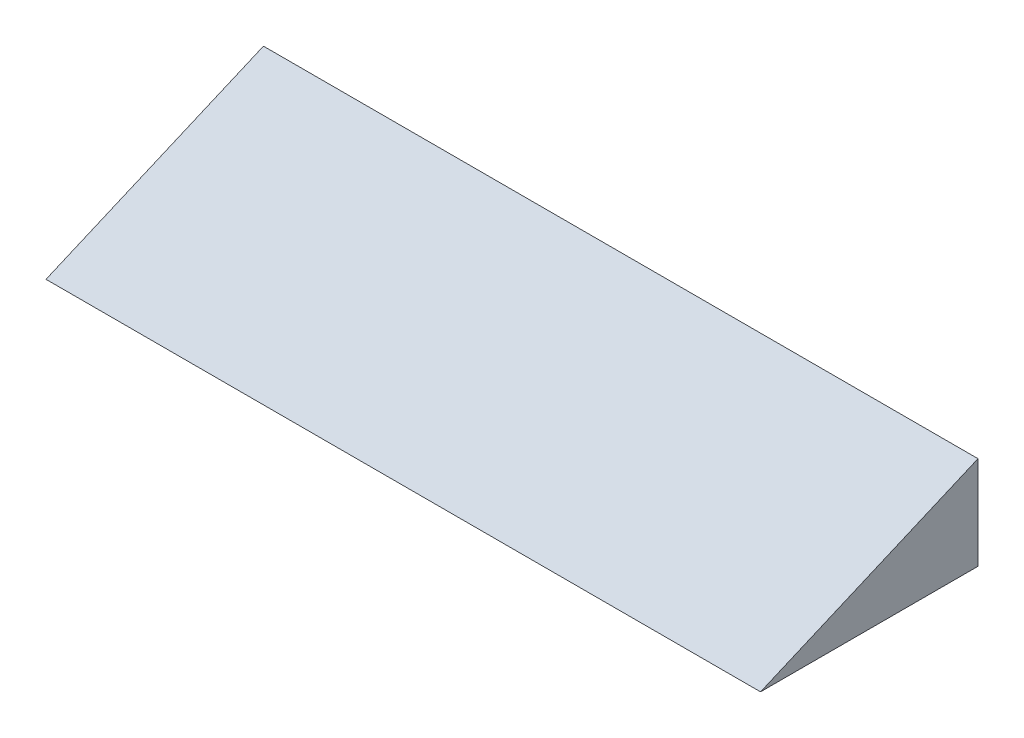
ISO-10303-21;
HEADER;
FILE_DESCRIPTION(('STEP AP214'),'2;1');
FILE_NAME('part.step','',(''),(''),'','','');
FILE_SCHEMA(('AUTOMOTIVE_DESIGN { 1 0 10303 214 1 1 1 1 }'));
ENDSEC;
DATA;
#1=APPLICATION_CONTEXT('core data for automotive mechanical design processes');
#2=APPLICATION_PROTOCOL_DEFINITION('international standard','automotive_design',2000,#1);
#3=PRODUCT_CONTEXT('',#1,'mechanical');
#4=PRODUCT('Part','Part','',(#3));
#5=PRODUCT_RELATED_PRODUCT_CATEGORY('part','',(#4));
#6=PRODUCT_DEFINITION_FORMATION('','',#4);
#7=PRODUCT_DEFINITION_CONTEXT('part definition',#1,'design');
#8=PRODUCT_DEFINITION('design','',#6,#7);
#9=PRODUCT_DEFINITION_SHAPE('','',#8);
#10=(LENGTH_UNIT() NAMED_UNIT(*) SI_UNIT(.MILLI.,.METRE.));
#11=(NAMED_UNIT(*) PLANE_ANGLE_UNIT() SI_UNIT($,.RADIAN.));
#12=(NAMED_UNIT(*) SI_UNIT($,.STERADIAN.) SOLID_ANGLE_UNIT());
#13=UNCERTAINTY_MEASURE_WITH_UNIT(LENGTH_MEASURE(1.E-05),#10,'distance_accuracy_value','');
#14=(GEOMETRIC_REPRESENTATION_CONTEXT(3) GLOBAL_UNCERTAINTY_ASSIGNED_CONTEXT((#13)) GLOBAL_UNIT_ASSIGNED_CONTEXT((#10,
#11,#12)) REPRESENTATION_CONTEXT('',''));
#15=CARTESIAN_POINT('',(0.,0.,0.));
#16=DIRECTION('',(0.,0.,1.));
#17=DIRECTION('',(1.,0.,0.));
#18=AXIS2_PLACEMENT_3D('',#15,#16,#17);
#19=CARTESIAN_POINT('',(292.1,0.,88.9));
#20=DIRECTION('',(0.,1.,0.));
#21=DIRECTION('',(0.,0.,1.));
#22=AXIS2_PLACEMENT_3D('',#19,#20,#21);
#23=PLANE('',#22);
#24=DIRECTION('',(0.,0.,-1.));
#25=VECTOR('',#24,1.);
#26=CARTESIAN_POINT('',(0.,0.,88.9));
#27=LINE('',#26,#25);
#28=CARTESIAN_POINT('',(0.,0.,88.9));
#29=VERTEX_POINT('',#28);
#30=CARTESIAN_POINT('',(0.,0.,0.));
#31=VERTEX_POINT('',#30);
#32=EDGE_CURVE('E77',#29,#31,#27,.T.);
#33=ORIENTED_EDGE('',*,*,#32,.T.);
#34=DIRECTION('',(-1.,0.,0.));
#35=VECTOR('',#34,1.);
#36=CARTESIAN_POINT('',(292.1,0.,0.));
#37=LINE('',#36,#35);
#38=CARTESIAN_POINT('',(292.1,0.,0.));
#39=VERTEX_POINT('',#38);
#40=EDGE_CURVE('E11',#39,#31,#37,.T.);
#41=ORIENTED_EDGE('',*,*,#40,.F.);
#42=DIRECTION('',(0.,0.,-1.));
#43=VECTOR('',#42,1.);
#44=CARTESIAN_POINT('',(292.1,0.,88.9));
#45=LINE('',#44,#43);
#46=CARTESIAN_POINT('',(292.1,0.,88.9));
#47=VERTEX_POINT('',#46);
#48=EDGE_CURVE('E70',#47,#39,#45,.T.);
#49=ORIENTED_EDGE('',*,*,#48,.F.);
#50=DIRECTION('',(-1.,0.,0.));
#51=VECTOR('',#50,1.);
#52=CARTESIAN_POINT('',(292.1,0.,88.9));
#53=LINE('',#52,#51);
#54=EDGE_CURVE('E78',#47,#29,#53,.T.);
#55=ORIENTED_EDGE('',*,*,#54,.T.);
#56=EDGE_LOOP('',(#33,#41,#49,#55));
#57=FACE_BOUND('',#56,.T.);
#58=ADVANCED_FACE('F30',(#57),#23,.F.);
#59=CARTESIAN_POINT('',(292.1,0.,0.));
#60=DIRECTION('',(0.,0.,1.));
#61=DIRECTION('',(1.,0.,0.));
#62=AXIS2_PLACEMENT_3D('',#59,#60,#61);
#63=PLANE('',#62);
#64=DIRECTION('',(0.,1.,0.));
#65=VECTOR('',#64,1.);
#66=CARTESIAN_POINT('',(0.,0.,0.));
#67=LINE('',#66,#65);
#68=CARTESIAN_POINT('',(0.,38.1,0.));
#69=VERTEX_POINT('',#68);
#70=EDGE_CURVE('E58',#31,#69,#67,.T.);
#71=ORIENTED_EDGE('',*,*,#70,.T.);
#72=DIRECTION('',(-1.,0.,0.));
#73=VECTOR('',#72,1.);
#74=CARTESIAN_POINT('',(292.1,38.1,0.));
#75=LINE('',#74,#73);
#76=CARTESIAN_POINT('',(292.1,38.1,0.));
#77=VERTEX_POINT('',#76);
#78=EDGE_CURVE('E38',#77,#69,#75,.T.);
#79=ORIENTED_EDGE('',*,*,#78,.F.);
#80=DIRECTION('',(0.,1.,0.));
#81=VECTOR('',#80,1.);
#82=CARTESIAN_POINT('',(292.1,0.,0.));
#83=LINE('',#82,#81);
#84=EDGE_CURVE('E66',#39,#77,#83,.T.);
#85=ORIENTED_EDGE('',*,*,#84,.F.);
#86=ORIENTED_EDGE('',*,*,#40,.T.);
#87=EDGE_LOOP('',(#71,#79,#85,#86));
#88=FACE_BOUND('',#87,.T.);
#89=ADVANCED_FACE('F67',(#88),#63,.F.);
#90=CARTESIAN_POINT('',(292.1,38.1,0.));
#91=DIRECTION('',(0.,-0.919145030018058,-0.393919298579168));
#92=DIRECTION('',(0.,0.393919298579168,-0.919145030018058));
#93=AXIS2_PLACEMENT_3D('',#90,#91,#92);
#94=PLANE('',#93);
#95=DIRECTION('',(0.,-0.393919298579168,0.919145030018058));
#96=VECTOR('',#95,1.);
#97=CARTESIAN_POINT('',(0.,38.1,0.));
#98=LINE('',#97,#96);
#99=EDGE_CURVE('E63',#69,#29,#98,.T.);
#100=ORIENTED_EDGE('',*,*,#99,.T.);
#101=ORIENTED_EDGE('',*,*,#54,.F.);
#102=DIRECTION('',(0.,-0.393919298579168,0.919145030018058));
#103=VECTOR('',#102,1.);
#104=CARTESIAN_POINT('',(292.1,38.1,0.));
#105=LINE('',#104,#103);
#106=EDGE_CURVE('E46',#77,#47,#105,.T.);
#107=ORIENTED_EDGE('',*,*,#106,.F.);
#108=ORIENTED_EDGE('',*,*,#78,.T.);
#109=EDGE_LOOP('',(#100,#101,#107,#108));
#110=FACE_BOUND('',#109,.T.);
#111=ADVANCED_FACE('F85',(#110),#94,.F.);
#112=CARTESIAN_POINT('',(292.1,0.,0.));
#113=DIRECTION('',(1.,0.,0.));
#114=DIRECTION('',(0.,0.,-1.));
#115=AXIS2_PLACEMENT_3D('',#112,#113,#114);
#116=PLANE('',#115);
#117=ORIENTED_EDGE('',*,*,#48,.T.);
#118=ORIENTED_EDGE('',*,*,#84,.T.);
#119=ORIENTED_EDGE('',*,*,#106,.T.);
#120=EDGE_LOOP('',(#117,#118,#119));
#121=FACE_BOUND('',#120,.T.);
#122=ADVANCED_FACE('F73',(#121),#116,.T.);
#123=CARTESIAN_POINT('',(0.,0.,0.));
#124=DIRECTION('',(1.,0.,0.));
#125=DIRECTION('',(0.,0.,-1.));
#126=AXIS2_PLACEMENT_3D('',#123,#124,#125);
#127=PLANE('',#126);
#128=ORIENTED_EDGE('',*,*,#32,.F.);
#129=ORIENTED_EDGE('',*,*,#99,.F.);
#130=ORIENTED_EDGE('',*,*,#70,.F.);
#131=EDGE_LOOP('',(#128,#129,#130));
#132=FACE_BOUND('',#131,.T.);
#133=ADVANCED_FACE('F86',(#132),#127,.F.);
#134=CLOSED_SHELL('',(#58,#89,#111,#122,#133));
#135=MANIFOLD_SOLID_BREP('B2',#134);
#136=ADVANCED_BREP_SHAPE_REPRESENTATION('',(#18,#135),#14);
#137=SHAPE_DEFINITION_REPRESENTATION(#9,#136);
ENDSEC;
END-ISO-10303-21;
